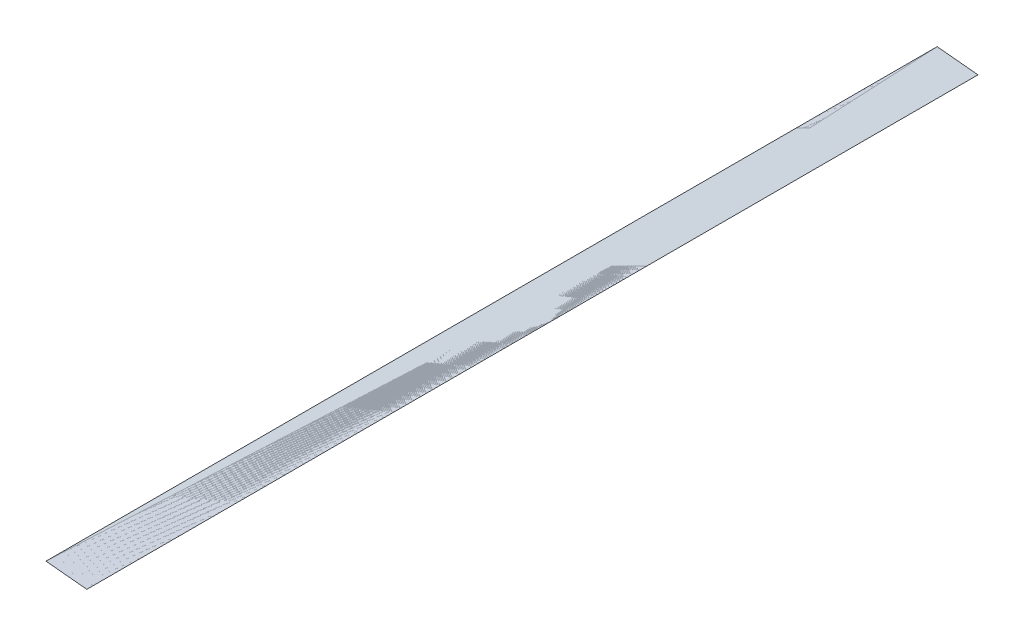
ISO-10303-21;
HEADER;
FILE_DESCRIPTION(('STEP AP214'),'2;1');
FILE_NAME('part.step','',(''),(''),'','','');
FILE_SCHEMA(('AUTOMOTIVE_DESIGN { 1 0 10303 214 1 1 1 1 }'));
ENDSEC;
DATA;
#1=APPLICATION_CONTEXT('core data for automotive mechanical design processes');
#2=APPLICATION_PROTOCOL_DEFINITION('international standard','automotive_design',2000,#1);
#3=PRODUCT_CONTEXT('',#1,'mechanical');
#4=PRODUCT('Part','Part','',(#3));
#5=PRODUCT_RELATED_PRODUCT_CATEGORY('part','',(#4));
#6=PRODUCT_DEFINITION_FORMATION('','',#4);
#7=PRODUCT_DEFINITION_CONTEXT('part definition',#1,'design');
#8=PRODUCT_DEFINITION('design','',#6,#7);
#9=PRODUCT_DEFINITION_SHAPE('','',#8);
#10=(LENGTH_UNIT() NAMED_UNIT(*) SI_UNIT(.MILLI.,.METRE.));
#11=(NAMED_UNIT(*) PLANE_ANGLE_UNIT() SI_UNIT($,.RADIAN.));
#12=(NAMED_UNIT(*) SI_UNIT($,.STERADIAN.) SOLID_ANGLE_UNIT());
#13=UNCERTAINTY_MEASURE_WITH_UNIT(LENGTH_MEASURE(1.E-05),#10,'distance_accuracy_value','');
#14=(GEOMETRIC_REPRESENTATION_CONTEXT(3) GLOBAL_UNCERTAINTY_ASSIGNED_CONTEXT((#13)) GLOBAL_UNIT_ASSIGNED_CONTEXT((#10,
#11,#12)) REPRESENTATION_CONTEXT('',''));
#15=CARTESIAN_POINT('',(0.,0.,0.));
#16=DIRECTION('',(0.,0.,1.));
#17=DIRECTION('',(1.,0.,0.));
#18=AXIS2_PLACEMENT_3D('',#15,#16,#17);
#19=CARTESIAN_POINT('',(287.207340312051,1142.35547189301,-920.981876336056));
#20=DIRECTION('',(1.4679475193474E-06,-0.999999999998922,2.65502653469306E-08));
#21=DIRECTION('',(0.999999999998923,1.46794751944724E-06,0.));
#22=AXIS2_PLACEMENT_3D('',#19,#20,#21);
#23=PLANE('',#22);
#24=CARTESIAN_POINT('',(234.132599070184,1142.35539326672,-947.925416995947));
#25=DIRECTION('',(-0.999999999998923,-1.46794939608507E-06,0.));
#26=VECTOR('',#25,1.);
#27=LINE('',#24,#26);
#28=CARTESIAN_POINT('',(234.132027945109,1142.34644642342,-947.925416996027));
#29=VERTEX_POINT('',#28);
#30=CARTESIAN_POINT('',(234.040365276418,1142.35539313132,-947.925416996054));
#31=VERTEX_POINT('',#30);
#32=EDGE_CURVE('E43',#29,#31,#27,.T.);
#33=ORIENTED_EDGE('',*,*,#32,.T.);
#34=DIRECTION('',(0.,0.,1.));
#35=VECTOR('',#34,1.);
#36=CARTESIAN_POINT('',(234.040365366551,1142.35539313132,-945.925416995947));
#37=LINE('',#36,#35);
#38=CARTESIAN_POINT('',(234.040365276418,1142.35539314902,-945.925416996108));
#39=VERTEX_POINT('',#38);
#40=EDGE_CURVE('E41',#31,#39,#37,.T.);
#41=ORIENTED_EDGE('',*,*,#40,.T.);
#42=CARTESIAN_POINT('',(234.040365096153,1142.35539318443,-945.925416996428));
#43=DIRECTION('',(0.999999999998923,1.46794698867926E-06,0.));
#44=VECTOR('',#43,1.);
#45=LINE('',#42,#44);
#46=CARTESIAN_POINT('',(234.132027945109,1142.34644644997,-945.925416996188));
#47=VERTEX_POINT('',#46);
#48=EDGE_CURVE('E28',#39,#47,#45,.T.);
#49=ORIENTED_EDGE('',*,*,#48,.T.);
#50=CARTESIAN_POINT('',(234.132599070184,1142.35539331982,-945.925416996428));
#51=DIRECTION('',(0.,-2.6550206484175E-08,-1.));
#52=VECTOR('',#51,1.);
#53=LINE('',#50,#52);
#54=EDGE_CURVE('E11',#47,#29,#53,.T.);
#55=ORIENTED_EDGE('',*,*,#54,.T.);
#56=EDGE_LOOP('',(#33,#41,#49,#55));
#57=FACE_BOUND('',#56,.T.);
#58=ADVANCED_FACE('F16',(#57),#23,.F.);
#59=CARTESIAN_POINT('',(234.132599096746,1142.33727519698,-945.925416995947));
#60=DIRECTION('',(0.192751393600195,0.981247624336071,0.));
#61=DIRECTION('',(-0.981247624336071,0.192751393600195,0.));
#62=AXIS2_PLACEMENT_3D('',#59,#60,#61);
#63=PLANE('',#62);
#64=ORIENTED_EDGE('',*,*,#48,.F.);
#65=ORIENTED_EDGE('',*,*,#40,.F.);
#66=ORIENTED_EDGE('',*,*,#32,.F.);
#67=ORIENTED_EDGE('',*,*,#54,.F.);
#68=EDGE_LOOP('',(#64,#65,#66,#67));
#69=FACE_BOUND('',#68,.T.);
#70=ADVANCED_FACE('F18',(#69),#63,.F.);
#71=CLOSED_SHELL('',(#58,#70));
#72=MANIFOLD_SOLID_BREP('B1',#71);
#73=ADVANCED_BREP_SHAPE_REPRESENTATION('',(#18,#72),#14);
#74=SHAPE_DEFINITION_REPRESENTATION(#9,#73);
ENDSEC;
END-ISO-10303-21;
